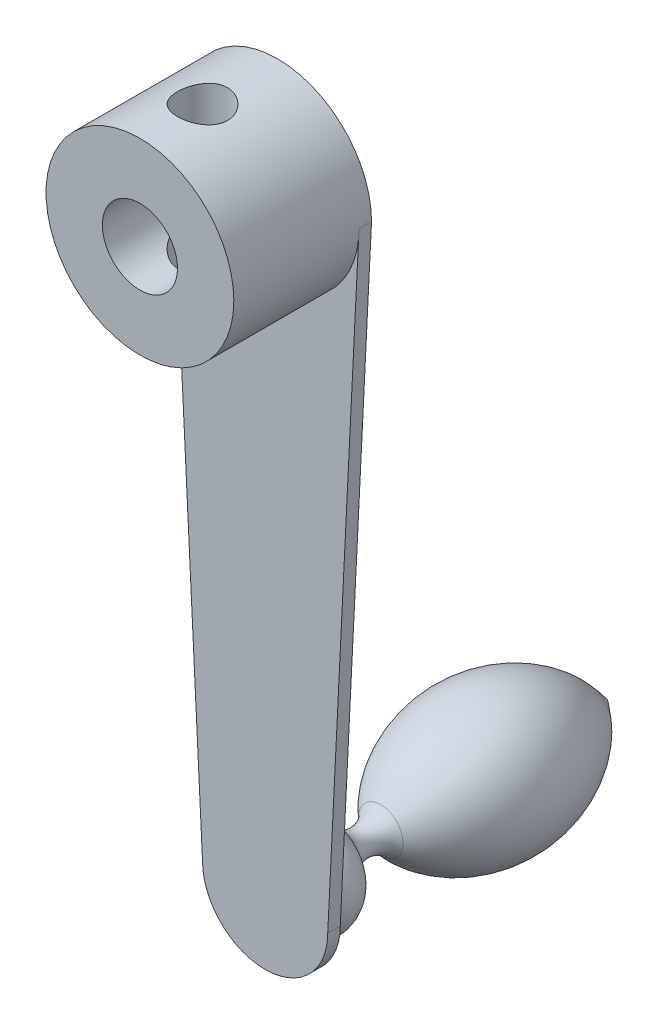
from build123d import *

# Parameters (mm, degrees)
SKETCH1_R      = 3
EXTRUDE1_DEPTH = 1
SKETCH2_R      = 7.5
SKETCH2_R_2    = 3
EXTRUDE2_DEPTH = 10
SKETCH3_R      = 2
EXTRUDE3_DEPTH = 60.021182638


with BuildPart() as part:
    # Sketch1 → Extrude1 (new body)
    with BuildSketch(Plane.XY):
        with BuildLine():
            Line((-7.5, 50), (-5, 0))
            ThreePointArc((-5, 0), (0, -5), (5, 0))
            Line((5, 0), (7.5, 50))
            ThreePointArc((7.5, 50), (0, 57.5), (-7.5, 50))
        make_face()
        with Locations((0, 50)):
            Circle(SKETCH1_R, mode=Mode.SUBTRACT)
    extrude(amount=EXTRUDE1_DEPTH)

    # Sketch2 → Extrude2 (add)
    with BuildSketch(Plane.XY.offset(1)):
        with Locations((0, 50)):
            Circle(SKETCH2_R)
        with Locations((0, 50)):
            Circle(SKETCH2_R_2, mode=Mode.SUBTRACT)
    extrude(amount=EXTRUDE2_DEPTH)

    # Sketch3 → Extrude3 (cut, through all)
    with BuildSketch(Plane(origin=(0, 0, 0), x_dir=(1, 0, 0), z_dir=(0, 1, 0))):
        with Locations(Location((0, -6, 0), (0, 0, 90))):
            Circle(SKETCH3_R)
    extrude(amount=EXTRUDE3_DEPTH, mode=Mode.SUBTRACT)

    # Sketch5 → Revolve1 (revolve)
    with BuildSketch(Plane(origin=(0, 0, 0), x_dir=(0, 0, -1), z_dir=(1, 0, 0)), mode=Mode.PRIVATE) as revolve1_sk:
        with BuildLine():
            Line((0, 0), (26.345897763, 0))
            ThreePointArc((26.345897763, 0), (25.580616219, 0.939411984), (24.794543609, 1.861496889))
            ThreePointArc((24.794543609, 1.861496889), (16.498829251, 5.61084751), (8.238861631, 1.783388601))
            ThreePointArc((8.238861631, 1.783388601), (6.174658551, 1.015046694), (4.430939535, 2.360679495))
            ThreePointArc((4.430939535, 2.360679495), (2.413416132, 3.935727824), (0, 3.083319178))
            Line((0, 3.083319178), (0, 0))
        make_face()
    revolve(revolve1_sk.sketch.rotate(Axis((0, 0, 0), (0, 0, -1)), 90), axis=Axis((0, 0, 0), (0, 0, -1)))


solid = part.part
